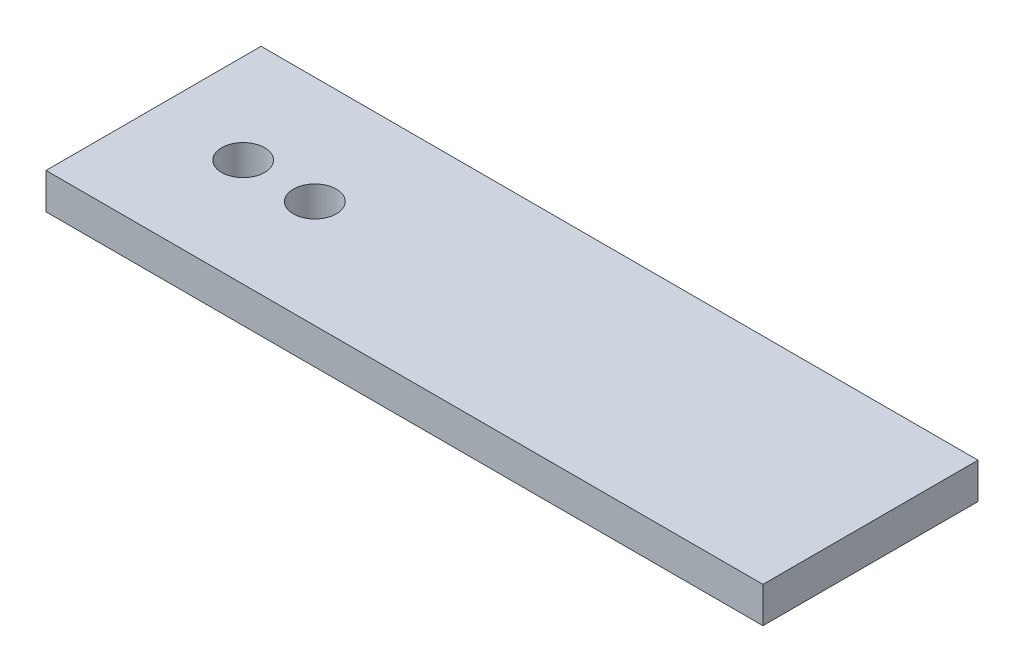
from build123d import *

# Parameters (mm, degrees)
BASESKETCH_W             = 200
BASESKETCH_H             = 60
BASEBOSS_DEPTH           = 10
SEEDHOLESKETCH_R         = 6
SEEDHOLECUT_DEPTH        = 10
HOLESLINEARPATTERN_COUNT = 2
HOLESLINEARPATTERN_PITCH = 20


with BuildPart() as part:
    # BaseSketch → BaseBoss (new body)
    with BuildSketch(Plane(origin=(0, 0, 0), x_dir=(1, 0, 0), z_dir=(0, 1, 0))):
        with Locations((100, 30)):
            Rectangle(BASESKETCH_W, BASESKETCH_H)
    extrude(amount=-BASEBOSS_DEPTH)

    # SeedHoleSketch → SeedHoleCut (cut)
    with BuildSketch(Plane(origin=(0, 0, 0), x_dir=(1, 0, 0), z_dir=(0, 1, 0))):
        with Locations(Location((25, 30, 0), (0, 0, 270))):
            Circle(SEEDHOLESKETCH_R)
    seedholecut = extrude(amount=-SEEDHOLECUT_DEPTH, mode=Mode.SUBTRACT)

    # HolesLinearPattern: SeedHoleCut ×2
    with Locations(*[(i * HOLESLINEARPATTERN_PITCH, 0, 0) for i in range(1, HOLESLINEARPATTERN_COUNT)]):
        add(seedholecut, mode=Mode.SUBTRACT)


solid = part.part
